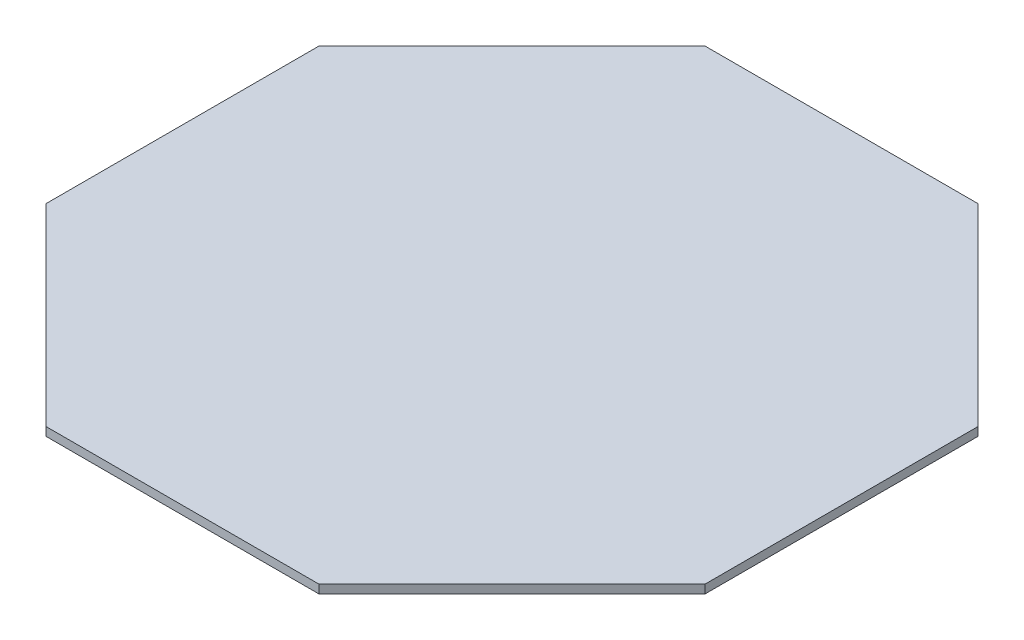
from build123d import *

# Parameters (mm, degrees)
BOSS_EXTRUDE1_DEPTH = 4.7625


with BuildPart() as part:
    # Sketch1 → Boss-Extrude1 (new body)
    with BuildSketch(Plane(origin=(0, 0, 0), x_dir=(1, 0, 0), z_dir=(0, 1, 0))):
        Polygon((76.2, -183.963073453), (183.963073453, -76.2), (183.963073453, 76.2), (76.2, 183.963073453), (-76.2, 183.963073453), (-183.963073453, 76.2), (-183.963073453, -76.2), (-76.2, -183.963073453), align=None)
    extrude(amount=BOSS_EXTRUDE1_DEPTH)


solid = part.part
